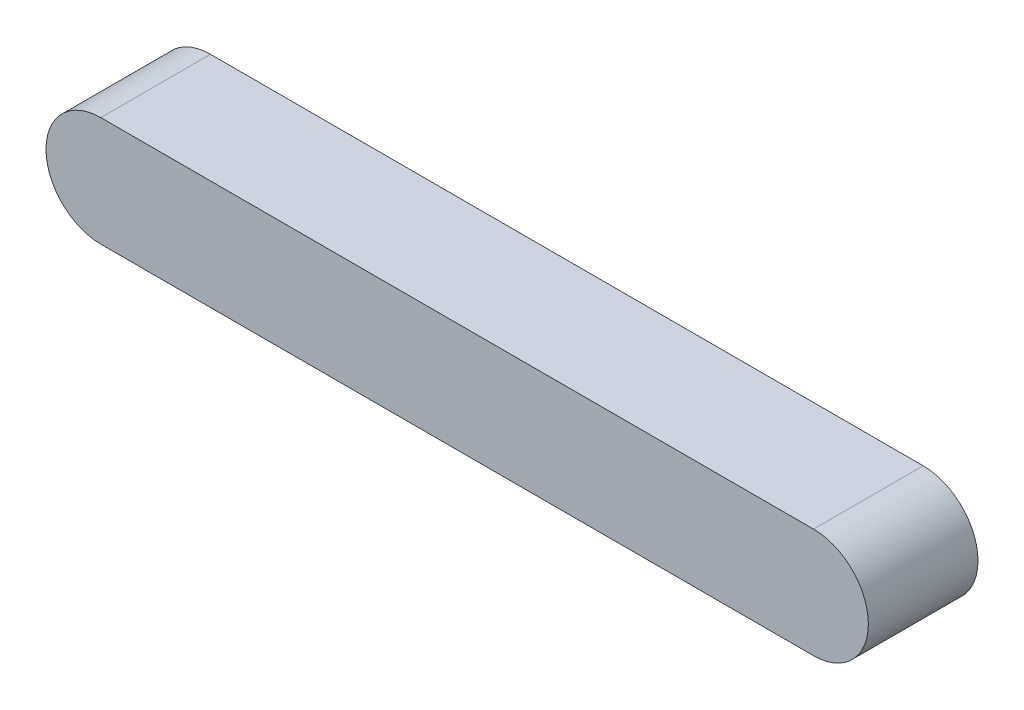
ISO-10303-21;
HEADER;
FILE_DESCRIPTION(('STEP AP214'),'2;1');
FILE_NAME('part.step','',(''),(''),'','','');
FILE_SCHEMA(('AUTOMOTIVE_DESIGN { 1 0 10303 214 1 1 1 1 }'));
ENDSEC;
DATA;
#1=APPLICATION_CONTEXT('core data for automotive mechanical design processes');
#2=APPLICATION_PROTOCOL_DEFINITION('international standard','automotive_design',2000,#1);
#3=PRODUCT_CONTEXT('',#1,'mechanical');
#4=PRODUCT('Part','Part','',(#3));
#5=PRODUCT_RELATED_PRODUCT_CATEGORY('part','',(#4));
#6=PRODUCT_DEFINITION_FORMATION('','',#4);
#7=PRODUCT_DEFINITION_CONTEXT('part definition',#1,'design');
#8=PRODUCT_DEFINITION('design','',#6,#7);
#9=PRODUCT_DEFINITION_SHAPE('','',#8);
#10=(LENGTH_UNIT() NAMED_UNIT(*) SI_UNIT(.MILLI.,.METRE.));
#11=(NAMED_UNIT(*) PLANE_ANGLE_UNIT() SI_UNIT($,.RADIAN.));
#12=(NAMED_UNIT(*) SI_UNIT($,.STERADIAN.) SOLID_ANGLE_UNIT());
#13=UNCERTAINTY_MEASURE_WITH_UNIT(LENGTH_MEASURE(1.E-05),#10,'distance_accuracy_value','');
#14=(GEOMETRIC_REPRESENTATION_CONTEXT(3) GLOBAL_UNCERTAINTY_ASSIGNED_CONTEXT((#13)) GLOBAL_UNIT_ASSIGNED_CONTEXT((#10,
#11,#12)) REPRESENTATION_CONTEXT('',''));
#15=CARTESIAN_POINT('',(0.,0.,0.));
#16=DIRECTION('',(0.,0.,1.));
#17=DIRECTION('',(1.,0.,0.));
#18=AXIS2_PLACEMENT_3D('',#15,#16,#17);
#19=CARTESIAN_POINT('',(-19.5,0.,6.));
#20=DIRECTION('',(0.,0.,-1.));
#21=DIRECTION('',(-1.,0.,0.));
#22=AXIS2_PLACEMENT_3D('',#19,#20,#21);
#23=CYLINDRICAL_SURFACE('',#22,3.);
#24=CARTESIAN_POINT('',(-19.5,0.,0.));
#25=DIRECTION('',(0.,0.,1.));
#26=DIRECTION('',(1.,0.,0.));
#27=AXIS2_PLACEMENT_3D('',#24,#25,#26);
#28=CIRCLE('',#27,3.);
#29=CARTESIAN_POINT('',(-19.5,3.,0.));
#30=VERTEX_POINT('',#29);
#31=CARTESIAN_POINT('',(-19.5,-3.,0.));
#32=VERTEX_POINT('',#31);
#33=EDGE_CURVE('E94',#30,#32,#28,.T.);
#34=ORIENTED_EDGE('',*,*,#33,.T.);
#35=DIRECTION('',(0.,0.,-1.));
#36=VECTOR('',#35,1.);
#37=CARTESIAN_POINT('',(-19.5,-3.,6.));
#38=LINE('',#37,#36);
#39=CARTESIAN_POINT('',(-19.5,-3.,6.));
#40=VERTEX_POINT('',#39);
#41=EDGE_CURVE('E11',#40,#32,#38,.T.);
#42=ORIENTED_EDGE('',*,*,#41,.F.);
#43=CARTESIAN_POINT('',(-19.5,0.,6.));
#44=DIRECTION('',(0.,0.,1.));
#45=DIRECTION('',(1.,0.,0.));
#46=AXIS2_PLACEMENT_3D('',#43,#44,#45);
#47=CIRCLE('',#46,3.);
#48=CARTESIAN_POINT('',(-19.5,3.,6.));
#49=VERTEX_POINT('',#48);
#50=EDGE_CURVE('E82',#49,#40,#47,.T.);
#51=ORIENTED_EDGE('',*,*,#50,.F.);
#52=DIRECTION('',(0.,0.,-1.));
#53=VECTOR('',#52,1.);
#54=CARTESIAN_POINT('',(-19.5,3.,6.));
#55=LINE('',#54,#53);
#56=EDGE_CURVE('E90',#49,#30,#55,.T.);
#57=ORIENTED_EDGE('',*,*,#56,.T.);
#58=EDGE_LOOP('',(#34,#42,#51,#57));
#59=FACE_BOUND('',#58,.T.);
#60=ADVANCED_FACE('F31',(#59),#23,.T.);
#61=CARTESIAN_POINT('',(-19.5,-3.,6.));
#62=DIRECTION('',(0.,1.,0.));
#63=DIRECTION('',(0.,0.,1.));
#64=AXIS2_PLACEMENT_3D('',#61,#62,#63);
#65=PLANE('',#64);
#66=DIRECTION('',(1.,0.,0.));
#67=VECTOR('',#66,1.);
#68=CARTESIAN_POINT('',(-19.5,-3.,0.));
#69=LINE('',#68,#67);
#70=CARTESIAN_POINT('',(19.5,-3.,0.));
#71=VERTEX_POINT('',#70);
#72=EDGE_CURVE('E86',#32,#71,#69,.T.);
#73=ORIENTED_EDGE('',*,*,#72,.T.);
#74=DIRECTION('',(0.,0.,-1.));
#75=VECTOR('',#74,1.);
#76=CARTESIAN_POINT('',(19.5,-3.,6.));
#77=LINE('',#76,#75);
#78=CARTESIAN_POINT('',(19.5,-3.,6.));
#79=VERTEX_POINT('',#78);
#80=EDGE_CURVE('E39',#79,#71,#77,.T.);
#81=ORIENTED_EDGE('',*,*,#80,.F.);
#82=DIRECTION('',(1.,0.,0.));
#83=VECTOR('',#82,1.);
#84=CARTESIAN_POINT('',(-19.5,-3.,6.));
#85=LINE('',#84,#83);
#86=EDGE_CURVE('E77',#40,#79,#85,.T.);
#87=ORIENTED_EDGE('',*,*,#86,.F.);
#88=ORIENTED_EDGE('',*,*,#41,.T.);
#89=EDGE_LOOP('',(#73,#81,#87,#88));
#90=FACE_BOUND('',#89,.T.);
#91=ADVANCED_FACE('F85',(#90),#65,.F.);
#92=CARTESIAN_POINT('',(19.5,0.,6.));
#93=DIRECTION('',(0.,0.,-1.));
#94=DIRECTION('',(-1.,0.,0.));
#95=AXIS2_PLACEMENT_3D('',#92,#93,#94);
#96=CYLINDRICAL_SURFACE('',#95,3.);
#97=CARTESIAN_POINT('',(19.5,0.,0.));
#98=DIRECTION('',(0.,0.,1.));
#99=DIRECTION('',(1.,0.,0.));
#100=AXIS2_PLACEMENT_3D('',#97,#98,#99);
#101=CIRCLE('',#100,3.);
#102=CARTESIAN_POINT('',(19.5,3.,0.));
#103=VERTEX_POINT('',#102);
#104=EDGE_CURVE('E64',#71,#103,#101,.T.);
#105=ORIENTED_EDGE('',*,*,#104,.T.);
#106=DIRECTION('',(0.,0.,-1.));
#107=VECTOR('',#106,1.);
#108=CARTESIAN_POINT('',(19.5,3.,6.));
#109=LINE('',#108,#107);
#110=CARTESIAN_POINT('',(19.5,3.,6.));
#111=VERTEX_POINT('',#110);
#112=EDGE_CURVE('E87',#111,#103,#109,.T.);
#113=ORIENTED_EDGE('',*,*,#112,.F.);
#114=CARTESIAN_POINT('',(19.5,0.,6.));
#115=DIRECTION('',(0.,0.,1.));
#116=DIRECTION('',(1.,0.,0.));
#117=AXIS2_PLACEMENT_3D('',#114,#115,#116);
#118=CIRCLE('',#117,3.);
#119=EDGE_CURVE('E80',#79,#111,#118,.T.);
#120=ORIENTED_EDGE('',*,*,#119,.F.);
#121=ORIENTED_EDGE('',*,*,#80,.T.);
#122=EDGE_LOOP('',(#105,#113,#120,#121));
#123=FACE_BOUND('',#122,.T.);
#124=ADVANCED_FACE('F88',(#123),#96,.T.);
#125=CARTESIAN_POINT('',(19.5,3.,6.));
#126=DIRECTION('',(0.,-1.,0.));
#127=DIRECTION('',(0.,0.,-1.));
#128=AXIS2_PLACEMENT_3D('',#125,#126,#127);
#129=PLANE('',#128);
#130=DIRECTION('',(-1.,0.,0.));
#131=VECTOR('',#130,1.);
#132=CARTESIAN_POINT('',(19.5,3.,0.));
#133=LINE('',#132,#131);
#134=EDGE_CURVE('E70',#103,#30,#133,.T.);
#135=ORIENTED_EDGE('',*,*,#134,.T.);
#136=ORIENTED_EDGE('',*,*,#56,.F.);
#137=DIRECTION('',(-1.,0.,0.));
#138=VECTOR('',#137,1.);
#139=CARTESIAN_POINT('',(19.5,3.,6.));
#140=LINE('',#139,#138);
#141=EDGE_CURVE('E47',#111,#49,#140,.T.);
#142=ORIENTED_EDGE('',*,*,#141,.F.);
#143=ORIENTED_EDGE('',*,*,#112,.T.);
#144=EDGE_LOOP('',(#135,#136,#142,#143));
#145=FACE_BOUND('',#144,.T.);
#146=ADVANCED_FACE('F101',(#145),#129,.F.);
#147=CARTESIAN_POINT('',(-19.5,0.,6.));
#148=DIRECTION('',(0.,0.,1.));
#149=DIRECTION('',(1.,0.,0.));
#150=AXIS2_PLACEMENT_3D('',#147,#148,#149);
#151=PLANE('',#150);
#152=ORIENTED_EDGE('',*,*,#50,.T.);
#153=ORIENTED_EDGE('',*,*,#86,.T.);
#154=ORIENTED_EDGE('',*,*,#119,.T.);
#155=ORIENTED_EDGE('',*,*,#141,.T.);
#156=EDGE_LOOP('',(#152,#153,#154,#155));
#157=FACE_BOUND('',#156,.T.);
#158=ADVANCED_FACE('F78',(#157),#151,.T.);
#159=CARTESIAN_POINT('',(-19.5,0.,0.));
#160=DIRECTION('',(0.,0.,1.));
#161=DIRECTION('',(1.,0.,0.));
#162=AXIS2_PLACEMENT_3D('',#159,#160,#161);
#163=PLANE('',#162);
#164=ORIENTED_EDGE('',*,*,#33,.F.);
#165=ORIENTED_EDGE('',*,*,#134,.F.);
#166=ORIENTED_EDGE('',*,*,#104,.F.);
#167=ORIENTED_EDGE('',*,*,#72,.F.);
#168=EDGE_LOOP('',(#164,#165,#166,#167));
#169=FACE_BOUND('',#168,.T.);
#170=ADVANCED_FACE('F104',(#169),#163,.F.);
#171=CLOSED_SHELL('',(#60,#91,#124,#146,#158,#170));
#172=MANIFOLD_SOLID_BREP('B2',#171);
#173=ADVANCED_BREP_SHAPE_REPRESENTATION('',(#18,#172),#14);
#174=SHAPE_DEFINITION_REPRESENTATION(#9,#173);
ENDSEC;
END-ISO-10303-21;
